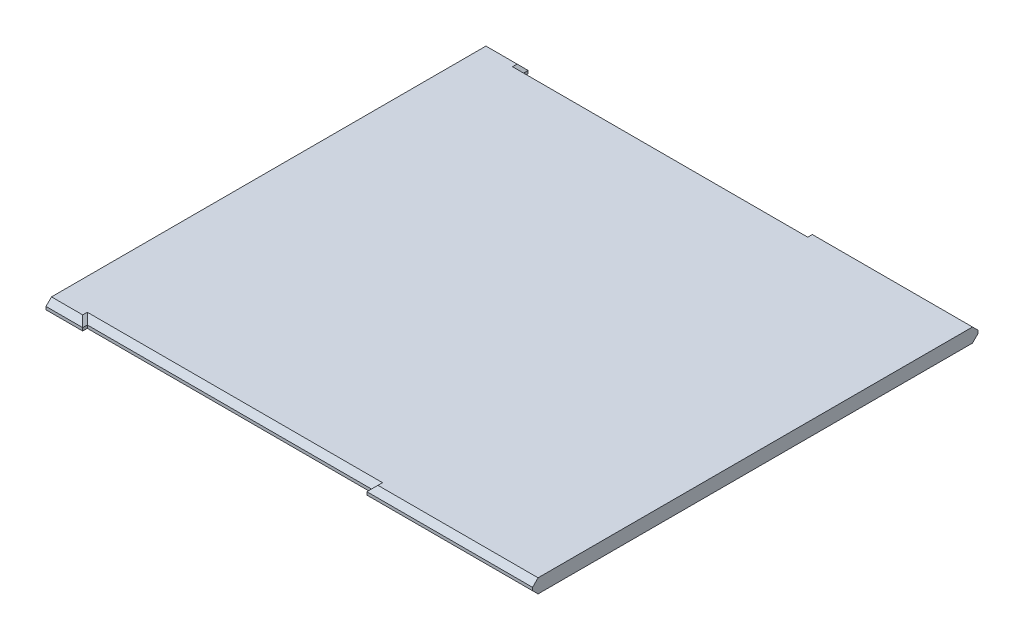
ISO-10303-21;
HEADER;
FILE_DESCRIPTION(('STEP AP214'),'2;1');
FILE_NAME('part.step','',(''),(''),'','','');
FILE_SCHEMA(('AUTOMOTIVE_DESIGN { 1 0 10303 214 1 1 1 1 }'));
ENDSEC;
DATA;
#1=APPLICATION_CONTEXT('core data for automotive mechanical design processes');
#2=APPLICATION_PROTOCOL_DEFINITION('international standard','automotive_design',2000,#1);
#3=PRODUCT_CONTEXT('',#1,'mechanical');
#4=PRODUCT('Part','Part','',(#3));
#5=PRODUCT_RELATED_PRODUCT_CATEGORY('part','',(#4));
#6=PRODUCT_DEFINITION_FORMATION('','',#4);
#7=PRODUCT_DEFINITION_CONTEXT('part definition',#1,'design');
#8=PRODUCT_DEFINITION('design','',#6,#7);
#9=PRODUCT_DEFINITION_SHAPE('','',#8);
#10=(LENGTH_UNIT() NAMED_UNIT(*) SI_UNIT(.MILLI.,.METRE.));
#11=(NAMED_UNIT(*) PLANE_ANGLE_UNIT() SI_UNIT($,.RADIAN.));
#12=(NAMED_UNIT(*) SI_UNIT($,.STERADIAN.) SOLID_ANGLE_UNIT());
#13=UNCERTAINTY_MEASURE_WITH_UNIT(LENGTH_MEASURE(1.E-05),#10,'distance_accuracy_value','');
#14=(GEOMETRIC_REPRESENTATION_CONTEXT(3) GLOBAL_UNCERTAINTY_ASSIGNED_CONTEXT((#13)) GLOBAL_UNIT_ASSIGNED_CONTEXT((#10,
#11,#12)) REPRESENTATION_CONTEXT('',''));
#15=CARTESIAN_POINT('',(0.,0.,0.));
#16=DIRECTION('',(0.,0.,1.));
#17=DIRECTION('',(1.,0.,0.));
#18=AXIS2_PLACEMENT_3D('',#15,#16,#17);
#19=CARTESIAN_POINT('',(-562.573544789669,19.05,-556.126720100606));
#20=DIRECTION('',(-1.,0.,0.));
#21=DIRECTION('',(0.,0.,1.));
#22=AXIS2_PLACEMENT_3D('',#19,#20,#21);
#23=PLANE('',#22);
#24=DIRECTION('',(0.,-1.,0.));
#25=VECTOR('',#24,1.);
#26=CARTESIAN_POINT('',(-562.573544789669,19.05,-556.126720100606));
#27=LINE('',#26,#25);
#28=CARTESIAN_POINT('',(-562.573544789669,4.0500000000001,-556.126720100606));
#29=VERTEX_POINT('',#28);
#30=CARTESIAN_POINT('',(-562.573544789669,-4.04999999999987,-556.126720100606));
#31=VERTEX_POINT('',#30);
#32=EDGE_CURVE('E395',#29,#31,#27,.T.);
#33=ORIENTED_EDGE('',*,*,#32,.T.);
#34=DIRECTION('',(0.,0.,-1.));
#35=VECTOR('',#34,1.);
#36=CARTESIAN_POINT('',(-562.573544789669,-4.04999999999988,-556.126720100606));
#37=LINE('',#36,#35);
#38=CARTESIAN_POINT('',(-562.573544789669,-4.04999999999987,-568.651720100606));
#39=VERTEX_POINT('',#38);
#40=EDGE_CURVE('E270',#31,#39,#37,.T.);
#41=ORIENTED_EDGE('',*,*,#40,.T.);
#42=DIRECTION('',(0.,-1.,0.));
#43=VECTOR('',#42,1.);
#44=CARTESIAN_POINT('',(-562.573544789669,19.05,-568.651720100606));
#45=LINE('',#44,#43);
#46=CARTESIAN_POINT('',(-562.573544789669,4.0500000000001,-568.651720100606));
#47=VERTEX_POINT('',#46);
#48=EDGE_CURVE('E229',#47,#39,#45,.T.);
#49=ORIENTED_EDGE('',*,*,#48,.F.);
#50=DIRECTION('',(0.,0.,1.));
#51=VECTOR('',#50,1.);
#52=CARTESIAN_POINT('',(-562.573544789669,4.0500000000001,-556.126720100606));
#53=LINE('',#52,#51);
#54=EDGE_CURVE('E264',#47,#29,#53,.T.);
#55=ORIENTED_EDGE('',*,*,#54,.T.);
#56=EDGE_LOOP('',(#33,#41,#49,#55));
#57=FACE_BOUND('',#56,.T.);
#58=ADVANCED_FACE('F44',(#57),#23,.F.);
#59=CARTESIAN_POINT('',(-562.573544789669,19.05,-568.651720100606));
#60=DIRECTION('',(0.,0.,1.));
#61=DIRECTION('',(1.,0.,0.));
#62=AXIS2_PLACEMENT_3D('',#59,#60,#61);
#63=PLANE('',#62);
#64=ORIENTED_EDGE('',*,*,#48,.T.);
#65=DIRECTION('',(-1.,0.,0.));
#66=VECTOR('',#65,1.);
#67=CARTESIAN_POINT('',(-562.573544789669,-4.04999999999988,-568.651720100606));
#68=LINE('',#67,#66);
#69=CARTESIAN_POINT('',(-662.573544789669,-4.04999999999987,-568.651720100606));
#70=VERTEX_POINT('',#69);
#71=EDGE_CURVE('E227',#39,#70,#68,.T.);
#72=ORIENTED_EDGE('',*,*,#71,.T.);
#73=DIRECTION('',(0.,-1.,0.));
#74=VECTOR('',#73,1.);
#75=CARTESIAN_POINT('',(-662.573544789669,19.05,-568.651720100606));
#76=LINE('',#75,#74);
#77=CARTESIAN_POINT('',(-662.573544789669,4.0500000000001,-568.651720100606));
#78=VERTEX_POINT('',#77);
#79=EDGE_CURVE('E215',#78,#70,#76,.T.);
#80=ORIENTED_EDGE('',*,*,#79,.F.);
#81=DIRECTION('',(1.,0.,0.));
#82=VECTOR('',#81,1.);
#83=CARTESIAN_POINT('',(-562.573544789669,4.0500000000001,-568.651720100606));
#84=LINE('',#83,#82);
#85=EDGE_CURVE('E228',#78,#47,#84,.T.);
#86=ORIENTED_EDGE('',*,*,#85,.T.);
#87=EDGE_LOOP('',(#64,#72,#80,#86));
#88=FACE_BOUND('',#87,.T.);
#89=ADVANCED_FACE('F223',(#88),#63,.F.);
#90=CARTESIAN_POINT('',(-662.573544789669,19.05,644.548279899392));
#91=DIRECTION('',(1.,0.,0.));
#92=DIRECTION('',(0.,0.,-1.));
#93=AXIS2_PLACEMENT_3D('',#90,#91,#92);
#94=PLANE('',#93);
#95=ORIENTED_EDGE('',*,*,#79,.T.);
#96=DIRECTION('',(0.,0.707106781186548,-0.707106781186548));
#97=VECTOR('',#96,1.);
#98=CARTESIAN_POINT('',(-662.573544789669,-4.04999999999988,-568.651720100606));
#99=LINE('',#98,#97);
#100=CARTESIAN_POINT('',(-662.573544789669,-19.05,-553.651720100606));
#101=VERTEX_POINT('',#100);
#102=EDGE_CURVE('E218',#70,#101,#99,.F.);
#103=ORIENTED_EDGE('',*,*,#102,.T.);
#104=DIRECTION('',(0.,0.,1.));
#105=VECTOR('',#104,1.);
#106=CARTESIAN_POINT('',(-662.573544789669,-19.05,644.548279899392));
#107=LINE('',#106,#105);
#108=CARTESIAN_POINT('',(-662.573544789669,-19.05,629.548279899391));
#109=VERTEX_POINT('',#108);
#110=EDGE_CURVE('E339',#101,#109,#107,.T.);
#111=ORIENTED_EDGE('',*,*,#110,.T.);
#112=DIRECTION('',(0.,-0.707106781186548,-0.707106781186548));
#113=VECTOR('',#112,1.);
#114=CARTESIAN_POINT('',(-662.573544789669,-4.04999999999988,644.548279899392));
#115=LINE('',#114,#113);
#116=CARTESIAN_POINT('',(-662.573544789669,-4.04999999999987,644.548279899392));
#117=VERTEX_POINT('',#116);
#118=EDGE_CURVE('E219',#109,#117,#115,.F.);
#119=ORIENTED_EDGE('',*,*,#118,.T.);
#120=DIRECTION('',(0.,-1.,0.));
#121=VECTOR('',#120,1.);
#122=CARTESIAN_POINT('',(-662.573544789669,19.05,644.548279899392));
#123=LINE('',#122,#121);
#124=CARTESIAN_POINT('',(-662.573544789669,4.0500000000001,644.548279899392));
#125=VERTEX_POINT('',#124);
#126=EDGE_CURVE('E231',#125,#117,#123,.T.);
#127=ORIENTED_EDGE('',*,*,#126,.F.);
#128=DIRECTION('',(0.,0.707106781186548,-0.707106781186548));
#129=VECTOR('',#128,1.);
#130=CARTESIAN_POINT('',(-662.573544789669,19.05,629.548279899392));
#131=LINE('',#130,#129);
#132=CARTESIAN_POINT('',(-662.573544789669,19.05,629.548279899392));
#133=VERTEX_POINT('',#132);
#134=EDGE_CURVE('E236',#125,#133,#131,.T.);
#135=ORIENTED_EDGE('',*,*,#134,.T.);
#136=DIRECTION('',(0.,0.,1.));
#137=VECTOR('',#136,1.);
#138=CARTESIAN_POINT('',(-662.573544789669,19.05,644.548279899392));
#139=LINE('',#138,#137);
#140=CARTESIAN_POINT('',(-662.573544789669,19.05,-553.651720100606));
#141=VERTEX_POINT('',#140);
#142=EDGE_CURVE('E212',#141,#133,#139,.T.);
#143=ORIENTED_EDGE('',*,*,#142,.F.);
#144=DIRECTION('',(0.,-0.707106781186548,-0.707106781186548));
#145=VECTOR('',#144,1.);
#146=CARTESIAN_POINT('',(-662.573544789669,19.05,-553.651720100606));
#147=LINE('',#146,#145);
#148=EDGE_CURVE('E207',#141,#78,#147,.T.);
#149=ORIENTED_EDGE('',*,*,#148,.T.);
#150=EDGE_LOOP('',(#95,#103,#111,#119,#127,#135,#143,#149));
#151=FACE_BOUND('',#150,.T.);
#152=ADVANCED_FACE('F211',(#151),#94,.F.);
#153=CARTESIAN_POINT('',(-562.573544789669,19.05,644.548279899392));
#154=DIRECTION('',(0.,0.,-1.));
#155=DIRECTION('',(-1.,0.,0.));
#156=AXIS2_PLACEMENT_3D('',#153,#154,#155);
#157=PLANE('',#156);
#158=ORIENTED_EDGE('',*,*,#126,.T.);
#159=DIRECTION('',(1.,0.,0.));
#160=VECTOR('',#159,1.);
#161=CARTESIAN_POINT('',(-562.573544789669,-4.04999999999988,644.548279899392));
#162=LINE('',#161,#160);
#163=CARTESIAN_POINT('',(-562.573544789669,-4.04999999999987,644.548279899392));
#164=VERTEX_POINT('',#163);
#165=EDGE_CURVE('E315',#117,#164,#162,.T.);
#166=ORIENTED_EDGE('',*,*,#165,.T.);
#167=DIRECTION('',(0.,-1.,0.));
#168=VECTOR('',#167,1.);
#169=CARTESIAN_POINT('',(-562.573544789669,19.05,644.548279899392));
#170=LINE('',#169,#168);
#171=CARTESIAN_POINT('',(-562.573544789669,4.0500000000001,644.548279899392));
#172=VERTEX_POINT('',#171);
#173=EDGE_CURVE('E419',#172,#164,#170,.T.);
#174=ORIENTED_EDGE('',*,*,#173,.F.);
#175=DIRECTION('',(-1.,0.,0.));
#176=VECTOR('',#175,1.);
#177=CARTESIAN_POINT('',(-662.573544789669,4.0500000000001,644.548279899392));
#178=LINE('',#177,#176);
#179=EDGE_CURVE('E309',#172,#125,#178,.T.);
#180=ORIENTED_EDGE('',*,*,#179,.T.);
#181=EDGE_LOOP('',(#158,#166,#174,#180));
#182=FACE_BOUND('',#181,.T.);
#183=ADVANCED_FACE('F430',(#182),#157,.F.);
#184=CARTESIAN_POINT('',(-562.573544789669,19.05,632.023279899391));
#185=DIRECTION('',(-1.,0.,0.));
#186=DIRECTION('',(0.,0.,1.));
#187=AXIS2_PLACEMENT_3D('',#184,#185,#186);
#188=PLANE('',#187);
#189=ORIENTED_EDGE('',*,*,#173,.T.);
#190=DIRECTION('',(0.,0.,-1.));
#191=VECTOR('',#190,1.);
#192=CARTESIAN_POINT('',(-562.573544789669,-4.04999999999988,632.023279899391));
#193=LINE('',#192,#191);
#194=CARTESIAN_POINT('',(-562.573544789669,-4.04999999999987,632.023279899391));
#195=VERTEX_POINT('',#194);
#196=EDGE_CURVE('E320',#164,#195,#193,.T.);
#197=ORIENTED_EDGE('',*,*,#196,.T.);
#198=DIRECTION('',(0.,-1.,0.));
#199=VECTOR('',#198,1.);
#200=CARTESIAN_POINT('',(-562.573544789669,19.05,632.023279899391));
#201=LINE('',#200,#199);
#202=CARTESIAN_POINT('',(-562.573544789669,4.0500000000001,632.023279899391));
#203=VERTEX_POINT('',#202);
#204=EDGE_CURVE('E417',#203,#195,#201,.T.);
#205=ORIENTED_EDGE('',*,*,#204,.F.);
#206=DIRECTION('',(0.,0.,1.));
#207=VECTOR('',#206,1.);
#208=CARTESIAN_POINT('',(-562.573544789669,4.0500000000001,644.548279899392));
#209=LINE('',#208,#207);
#210=EDGE_CURVE('E312',#203,#172,#209,.T.);
#211=ORIENTED_EDGE('',*,*,#210,.T.);
#212=EDGE_LOOP('',(#189,#197,#205,#211));
#213=FACE_BOUND('',#212,.T.);
#214=ADVANCED_FACE('F444',(#213),#188,.F.);
#215=CARTESIAN_POINT('',(211.426455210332,19.05,632.023279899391));
#216=DIRECTION('',(0.,0.,-1.));
#217=DIRECTION('',(-1.,0.,0.));
#218=AXIS2_PLACEMENT_3D('',#215,#216,#217);
#219=PLANE('',#218);
#220=ORIENTED_EDGE('',*,*,#204,.T.);
#221=DIRECTION('',(1.,0.,0.));
#222=VECTOR('',#221,1.);
#223=CARTESIAN_POINT('',(211.426455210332,-4.04999999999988,632.023279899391));
#224=LINE('',#223,#222);
#225=CARTESIAN_POINT('',(211.426455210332,-4.04999999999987,632.023279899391));
#226=VERTEX_POINT('',#225);
#227=EDGE_CURVE('E321',#195,#226,#224,.T.);
#228=ORIENTED_EDGE('',*,*,#227,.T.);
#229=DIRECTION('',(0.,-1.,0.));
#230=VECTOR('',#229,1.);
#231=CARTESIAN_POINT('',(211.426455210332,19.05,632.023279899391));
#232=LINE('',#231,#230);
#233=CARTESIAN_POINT('',(211.426455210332,4.0500000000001,632.023279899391));
#234=VERTEX_POINT('',#233);
#235=EDGE_CURVE('E414',#234,#226,#232,.T.);
#236=ORIENTED_EDGE('',*,*,#235,.F.);
#237=DIRECTION('',(-1.,0.,0.));
#238=VECTOR('',#237,1.);
#239=CARTESIAN_POINT('',(-562.573544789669,4.0500000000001,632.023279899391));
#240=LINE('',#239,#238);
#241=EDGE_CURVE('E317',#234,#203,#240,.T.);
#242=ORIENTED_EDGE('',*,*,#241,.T.);
#243=EDGE_LOOP('',(#220,#228,#236,#242));
#244=FACE_BOUND('',#243,.T.);
#245=ADVANCED_FACE('F450',(#244),#219,.F.);
#246=CARTESIAN_POINT('',(211.426455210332,19.05,632.023279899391));
#247=DIRECTION('',(1.,0.,0.));
#248=DIRECTION('',(0.,0.,-1.));
#249=AXIS2_PLACEMENT_3D('',#246,#247,#248);
#250=PLANE('',#249);
#251=ORIENTED_EDGE('',*,*,#235,.T.);
#252=DIRECTION('',(0.,0.,1.));
#253=VECTOR('',#252,1.);
#254=CARTESIAN_POINT('',(211.426455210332,-4.04999999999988,632.023279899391));
#255=LINE('',#254,#253);
#256=CARTESIAN_POINT('',(211.426455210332,-4.04999999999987,644.548279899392));
#257=VERTEX_POINT('',#256);
#258=EDGE_CURVE('E61',#226,#257,#255,.T.);
#259=ORIENTED_EDGE('',*,*,#258,.T.);
#260=DIRECTION('',(0.,-1.,0.));
#261=VECTOR('',#260,1.);
#262=CARTESIAN_POINT('',(211.426455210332,19.05,644.548279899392));
#263=LINE('',#262,#261);
#264=CARTESIAN_POINT('',(211.426455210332,4.0500000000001,644.548279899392));
#265=VERTEX_POINT('',#264);
#266=EDGE_CURVE('E412',#265,#257,#263,.T.);
#267=ORIENTED_EDGE('',*,*,#266,.F.);
#268=DIRECTION('',(0.,0.,-1.));
#269=VECTOR('',#268,1.);
#270=CARTESIAN_POINT('',(211.426455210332,4.0500000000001,632.023279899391));
#271=LINE('',#270,#269);
#272=EDGE_CURVE('E323',#265,#234,#271,.T.);
#273=ORIENTED_EDGE('',*,*,#272,.T.);
#274=EDGE_LOOP('',(#251,#259,#267,#273));
#275=FACE_BOUND('',#274,.T.);
#276=ADVANCED_FACE('F756',(#275),#250,.F.);
#277=CARTESIAN_POINT('',(211.426455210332,19.05,644.548279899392));
#278=DIRECTION('',(0.,0.,-1.));
#279=DIRECTION('',(-1.,0.,0.));
#280=AXIS2_PLACEMENT_3D('',#277,#278,#279);
#281=PLANE('',#280);
#282=ORIENTED_EDGE('',*,*,#266,.T.);
#283=DIRECTION('',(1.,0.,0.));
#284=VECTOR('',#283,1.);
#285=CARTESIAN_POINT('',(211.426455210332,-4.04999999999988,644.548279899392));
#286=LINE('',#285,#284);
#287=CARTESIAN_POINT('',(662.626455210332,-4.04999999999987,644.548279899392));
#288=VERTEX_POINT('',#287);
#289=EDGE_CURVE('E11',#257,#288,#286,.T.);
#290=ORIENTED_EDGE('',*,*,#289,.T.);
#291=DIRECTION('',(0.,-1.,0.));
#292=VECTOR('',#291,1.);
#293=CARTESIAN_POINT('',(662.626455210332,19.05,644.548279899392));
#294=LINE('',#293,#292);
#295=CARTESIAN_POINT('',(662.626455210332,4.0500000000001,644.548279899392));
#296=VERTEX_POINT('',#295);
#297=EDGE_CURVE('E411',#296,#288,#294,.T.);
#298=ORIENTED_EDGE('',*,*,#297,.F.);
#299=DIRECTION('',(-1.,0.,0.));
#300=VECTOR('',#299,1.);
#301=CARTESIAN_POINT('',(211.426455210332,4.0500000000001,644.548279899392));
#302=LINE('',#301,#300);
#303=EDGE_CURVE('E54',#296,#265,#302,.T.);
#304=ORIENTED_EDGE('',*,*,#303,.T.);
#305=EDGE_LOOP('',(#282,#290,#298,#304));
#306=FACE_BOUND('',#305,.T.);
#307=ADVANCED_FACE('F465',(#306),#281,.F.);
#308=CARTESIAN_POINT('',(662.626455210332,19.05,644.548279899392));
#309=DIRECTION('',(-1.,0.,0.));
#310=DIRECTION('',(0.,0.,1.));
#311=AXIS2_PLACEMENT_3D('',#308,#309,#310);
#312=PLANE('',#311);
#313=DIRECTION('',(0.,0.,-1.));
#314=VECTOR('',#313,1.);
#315=CARTESIAN_POINT('',(662.626455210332,-19.05,644.548279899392));
#316=LINE('',#315,#314);
#317=CARTESIAN_POINT('',(662.626455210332,-19.05,629.548279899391));
#318=VERTEX_POINT('',#317);
#319=CARTESIAN_POINT('',(662.626455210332,-19.05,-553.651720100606));
#320=VERTEX_POINT('',#319);
#321=EDGE_CURVE('E400',#318,#320,#316,.T.);
#322=ORIENTED_EDGE('',*,*,#321,.T.);
#323=DIRECTION('',(0.,-0.707106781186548,0.707106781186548));
#324=VECTOR('',#323,1.);
#325=CARTESIAN_POINT('',(662.626455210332,-4.04999999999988,-568.651720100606));
#326=LINE('',#325,#324);
#327=CARTESIAN_POINT('',(662.626455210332,-4.04999999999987,-568.651720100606));
#328=VERTEX_POINT('',#327);
#329=EDGE_CURVE('E290',#320,#328,#326,.F.);
#330=ORIENTED_EDGE('',*,*,#329,.T.);
#331=DIRECTION('',(0.,-1.,0.));
#332=VECTOR('',#331,1.);
#333=CARTESIAN_POINT('',(662.626455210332,19.05,-568.651720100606));
#334=LINE('',#333,#332);
#335=CARTESIAN_POINT('',(662.626455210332,4.0500000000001,-568.651720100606));
#336=VERTEX_POINT('',#335);
#337=EDGE_CURVE('E406',#336,#328,#334,.T.);
#338=ORIENTED_EDGE('',*,*,#337,.F.);
#339=DIRECTION('',(0.,0.707106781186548,0.707106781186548));
#340=VECTOR('',#339,1.);
#341=CARTESIAN_POINT('',(662.626455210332,19.05,-553.651720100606));
#342=LINE('',#341,#340);
#343=CARTESIAN_POINT('',(662.626455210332,19.05,-553.651720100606));
#344=VERTEX_POINT('',#343);
#345=EDGE_CURVE('E284',#336,#344,#342,.T.);
#346=ORIENTED_EDGE('',*,*,#345,.T.);
#347=DIRECTION('',(0.,0.,-1.));
#348=VECTOR('',#347,1.);
#349=CARTESIAN_POINT('',(662.626455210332,19.05,644.548279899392));
#350=LINE('',#349,#348);
#351=CARTESIAN_POINT('',(662.626455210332,19.05,629.548279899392));
#352=VERTEX_POINT('',#351);
#353=EDGE_CURVE('E383',#352,#344,#350,.T.);
#354=ORIENTED_EDGE('',*,*,#353,.F.);
#355=DIRECTION('',(0.,-0.707106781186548,0.707106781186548));
#356=VECTOR('',#355,1.);
#357=CARTESIAN_POINT('',(662.626455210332,19.05,629.548279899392));
#358=LINE('',#357,#356);
#359=EDGE_CURVE('E283',#352,#296,#358,.T.);
#360=ORIENTED_EDGE('',*,*,#359,.T.);
#361=ORIENTED_EDGE('',*,*,#297,.T.);
#362=DIRECTION('',(0.,0.707106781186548,0.707106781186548));
#363=VECTOR('',#362,1.);
#364=CARTESIAN_POINT('',(662.626455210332,-4.04999999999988,644.548279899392));
#365=LINE('',#364,#363);
#366=EDGE_CURVE('E281',#288,#318,#365,.F.);
#367=ORIENTED_EDGE('',*,*,#366,.T.);
#368=EDGE_LOOP('',(#322,#330,#338,#346,#354,#360,#361,#367));
#369=FACE_BOUND('',#368,.T.);
#370=ADVANCED_FACE('F389',(#369),#312,.F.);
#371=CARTESIAN_POINT('',(211.426455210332,19.05,-568.651720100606));
#372=DIRECTION('',(0.,0.,1.));
#373=DIRECTION('',(1.,0.,0.));
#374=AXIS2_PLACEMENT_3D('',#371,#372,#373);
#375=PLANE('',#374);
#376=ORIENTED_EDGE('',*,*,#337,.T.);
#377=DIRECTION('',(-1.,0.,0.));
#378=VECTOR('',#377,1.);
#379=CARTESIAN_POINT('',(211.426455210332,-4.04999999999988,-568.651720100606));
#380=LINE('',#379,#378);
#381=CARTESIAN_POINT('',(211.426455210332,-4.04999999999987,-568.651720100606));
#382=VERTEX_POINT('',#381);
#383=EDGE_CURVE('E276',#328,#382,#380,.T.);
#384=ORIENTED_EDGE('',*,*,#383,.T.);
#385=DIRECTION('',(0.,-1.,0.));
#386=VECTOR('',#385,1.);
#387=CARTESIAN_POINT('',(211.426455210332,19.05,-568.651720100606));
#388=LINE('',#387,#386);
#389=CARTESIAN_POINT('',(211.426455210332,4.0500000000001,-568.651720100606));
#390=VERTEX_POINT('',#389);
#391=EDGE_CURVE('E403',#390,#382,#388,.T.);
#392=ORIENTED_EDGE('',*,*,#391,.F.);
#393=DIRECTION('',(1.,0.,0.));
#394=VECTOR('',#393,1.);
#395=CARTESIAN_POINT('',(662.626455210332,4.0500000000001,-568.651720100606));
#396=LINE('',#395,#394);
#397=EDGE_CURVE('E280',#390,#336,#396,.T.);
#398=ORIENTED_EDGE('',*,*,#397,.T.);
#399=EDGE_LOOP('',(#376,#384,#392,#398));
#400=FACE_BOUND('',#399,.T.);
#401=ADVANCED_FACE('F501',(#400),#375,.F.);
#402=CARTESIAN_POINT('',(211.426455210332,19.05,-556.126720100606));
#403=DIRECTION('',(1.,0.,0.));
#404=DIRECTION('',(0.,0.,-1.));
#405=AXIS2_PLACEMENT_3D('',#402,#403,#404);
#406=PLANE('',#405);
#407=ORIENTED_EDGE('',*,*,#391,.T.);
#408=DIRECTION('',(0.,0.,1.));
#409=VECTOR('',#408,1.);
#410=CARTESIAN_POINT('',(211.426455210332,-4.04999999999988,-556.126720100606));
#411=LINE('',#410,#409);
#412=CARTESIAN_POINT('',(211.426455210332,-4.04999999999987,-556.126720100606));
#413=VERTEX_POINT('',#412);
#414=EDGE_CURVE('E274',#382,#413,#411,.T.);
#415=ORIENTED_EDGE('',*,*,#414,.T.);
#416=DIRECTION('',(0.,-1.,0.));
#417=VECTOR('',#416,1.);
#418=CARTESIAN_POINT('',(211.426455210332,19.05,-556.126720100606));
#419=LINE('',#418,#417);
#420=CARTESIAN_POINT('',(211.426455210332,4.0500000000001,-556.126720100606));
#421=VERTEX_POINT('',#420);
#422=EDGE_CURVE('E394',#421,#413,#419,.T.);
#423=ORIENTED_EDGE('',*,*,#422,.F.);
#424=DIRECTION('',(0.,0.,-1.));
#425=VECTOR('',#424,1.);
#426=CARTESIAN_POINT('',(211.426455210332,4.0500000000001,-568.651720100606));
#427=LINE('',#426,#425);
#428=EDGE_CURVE('E272',#421,#390,#427,.T.);
#429=ORIENTED_EDGE('',*,*,#428,.T.);
#430=EDGE_LOOP('',(#407,#415,#423,#429));
#431=FACE_BOUND('',#430,.T.);
#432=ADVANCED_FACE('F481',(#431),#406,.F.);
#433=CARTESIAN_POINT('',(211.426455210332,19.05,-556.126720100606));
#434=DIRECTION('',(0.,0.,1.));
#435=DIRECTION('',(1.,0.,0.));
#436=AXIS2_PLACEMENT_3D('',#433,#434,#435);
#437=PLANE('',#436);
#438=ORIENTED_EDGE('',*,*,#422,.T.);
#439=DIRECTION('',(-1.,0.,0.));
#440=VECTOR('',#439,1.);
#441=CARTESIAN_POINT('',(211.426455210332,-4.04999999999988,-556.126720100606));
#442=LINE('',#441,#440);
#443=EDGE_CURVE('E271',#413,#31,#442,.T.);
#444=ORIENTED_EDGE('',*,*,#443,.T.);
#445=ORIENTED_EDGE('',*,*,#32,.F.);
#446=DIRECTION('',(1.,0.,0.));
#447=VECTOR('',#446,1.);
#448=CARTESIAN_POINT('',(211.426455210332,4.0500000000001,-556.126720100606));
#449=LINE('',#448,#447);
#450=EDGE_CURVE('E267',#29,#421,#449,.T.);
#451=ORIENTED_EDGE('',*,*,#450,.T.);
#452=EDGE_LOOP('',(#438,#444,#445,#451));
#453=FACE_BOUND('',#452,.T.);
#454=ADVANCED_FACE('F484',(#453),#437,.F.);
#455=CARTESIAN_POINT('',(0.,19.05,0.));
#456=DIRECTION('',(0.,1.,0.));
#457=DIRECTION('',(0.,0.,1.));
#458=AXIS2_PLACEMENT_3D('',#455,#456,#457);
#459=PLANE('',#458);
#460=DIRECTION('',(0.,0.,-1.));
#461=VECTOR('',#460,1.);
#462=CARTESIAN_POINT('',(-577.573544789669,19.05,-568.651720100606));
#463=LINE('',#462,#461);
#464=CARTESIAN_POINT('',(-577.573544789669,19.05,-541.126720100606));
#465=VERTEX_POINT('',#464);
#466=CARTESIAN_POINT('',(-577.573544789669,19.05,-553.651720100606));
#467=VERTEX_POINT('',#466);
#468=EDGE_CURVE('E308',#465,#467,#463,.T.);
#469=ORIENTED_EDGE('',*,*,#468,.T.);
#470=DIRECTION('',(-1.,0.,0.));
#471=VECTOR('',#470,1.);
#472=CARTESIAN_POINT('',(-662.573544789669,19.05,-553.651720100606));
#473=LINE('',#472,#471);
#474=EDGE_CURVE('E306',#467,#141,#473,.T.);
#475=ORIENTED_EDGE('',*,*,#474,.T.);
#476=ORIENTED_EDGE('',*,*,#142,.T.);
#477=DIRECTION('',(1.,0.,0.));
#478=VECTOR('',#477,1.);
#479=CARTESIAN_POINT('',(-562.573544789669,19.05,629.548279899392));
#480=LINE('',#479,#478);
#481=CARTESIAN_POINT('',(-577.573544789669,19.05,629.548279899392));
#482=VERTEX_POINT('',#481);
#483=EDGE_CURVE('E300',#133,#482,#480,.T.);
#484=ORIENTED_EDGE('',*,*,#483,.T.);
#485=DIRECTION('',(0.,0.,-1.));
#486=VECTOR('',#485,1.);
#487=CARTESIAN_POINT('',(-577.573544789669,19.05,632.023279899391));
#488=LINE('',#487,#486);
#489=CARTESIAN_POINT('',(-577.573544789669,19.05,617.023279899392));
#490=VERTEX_POINT('',#489);
#491=EDGE_CURVE('E293',#482,#490,#488,.T.);
#492=ORIENTED_EDGE('',*,*,#491,.T.);
#493=DIRECTION('',(1.,0.,0.));
#494=VECTOR('',#493,1.);
#495=CARTESIAN_POINT('',(211.426455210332,19.05,617.023279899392));
#496=LINE('',#495,#494);
#497=CARTESIAN_POINT('',(226.426455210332,19.05,617.023279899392));
#498=VERTEX_POINT('',#497);
#499=EDGE_CURVE('E291',#490,#498,#496,.T.);
#500=ORIENTED_EDGE('',*,*,#499,.T.);
#501=DIRECTION('',(0.,0.,1.));
#502=VECTOR('',#501,1.);
#503=CARTESIAN_POINT('',(226.426455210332,19.05,644.548279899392));
#504=LINE('',#503,#502);
#505=CARTESIAN_POINT('',(226.426455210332,19.05,629.548279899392));
#506=VERTEX_POINT('',#505);
#507=EDGE_CURVE('E292',#498,#506,#504,.T.);
#508=ORIENTED_EDGE('',*,*,#507,.T.);
#509=DIRECTION('',(1.,0.,0.));
#510=VECTOR('',#509,1.);
#511=CARTESIAN_POINT('',(662.626455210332,19.05,629.548279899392));
#512=LINE('',#511,#510);
#513=EDGE_CURVE('E288',#506,#352,#512,.T.);
#514=ORIENTED_EDGE('',*,*,#513,.T.);
#515=ORIENTED_EDGE('',*,*,#353,.T.);
#516=DIRECTION('',(-1.,0.,0.));
#517=VECTOR('',#516,1.);
#518=CARTESIAN_POINT('',(211.426455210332,19.05,-553.651720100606));
#519=LINE('',#518,#517);
#520=CARTESIAN_POINT('',(226.426455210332,19.05,-553.651720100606));
#521=VERTEX_POINT('',#520);
#522=EDGE_CURVE('E305',#344,#521,#519,.T.);
#523=ORIENTED_EDGE('',*,*,#522,.T.);
#524=DIRECTION('',(0.,0.,1.));
#525=VECTOR('',#524,1.);
#526=CARTESIAN_POINT('',(226.426455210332,19.05,-556.126720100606));
#527=LINE('',#526,#525);
#528=CARTESIAN_POINT('',(226.426455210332,19.05,-541.126720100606));
#529=VERTEX_POINT('',#528);
#530=EDGE_CURVE('E299',#521,#529,#527,.T.);
#531=ORIENTED_EDGE('',*,*,#530,.T.);
#532=DIRECTION('',(-1.,0.,0.));
#533=VECTOR('',#532,1.);
#534=CARTESIAN_POINT('',(-562.573544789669,19.05,-541.126720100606));
#535=LINE('',#534,#533);
#536=EDGE_CURVE('E303',#529,#465,#535,.T.);
#537=ORIENTED_EDGE('',*,*,#536,.T.);
#538=EDGE_LOOP('',(#469,#475,#476,#484,#492,#500,#508,#514,#515,#523,#531,#537));
#539=FACE_BOUND('',#538,.T.);
#540=ADVANCED_FACE('F382',(#539),#459,.T.);
#541=CARTESIAN_POINT('',(0.,-19.05,0.));
#542=DIRECTION('',(0.,1.,0.));
#543=DIRECTION('',(0.,0.,1.));
#544=AXIS2_PLACEMENT_3D('',#541,#542,#543);
#545=PLANE('',#544);
#546=ORIENTED_EDGE('',*,*,#110,.F.);
#547=DIRECTION('',(1.,0.,0.));
#548=VECTOR('',#547,1.);
#549=CARTESIAN_POINT('',(0.,-19.05,-553.651720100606));
#550=LINE('',#549,#548);
#551=CARTESIAN_POINT('',(-577.573544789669,-19.05,-553.651720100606));
#552=VERTEX_POINT('',#551);
#553=EDGE_CURVE('E263',#101,#552,#550,.T.);
#554=ORIENTED_EDGE('',*,*,#553,.T.);
#555=DIRECTION('',(0.,0.,1.));
#556=VECTOR('',#555,1.);
#557=CARTESIAN_POINT('',(-577.573544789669,-19.05,0.));
#558=LINE('',#557,#556);
#559=CARTESIAN_POINT('',(-577.573544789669,-19.05,-541.126720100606));
#560=VERTEX_POINT('',#559);
#561=EDGE_CURVE('E261',#552,#560,#558,.T.);
#562=ORIENTED_EDGE('',*,*,#561,.T.);
#563=DIRECTION('',(1.,0.,0.));
#564=VECTOR('',#563,1.);
#565=CARTESIAN_POINT('',(0.,-19.05,-541.126720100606));
#566=LINE('',#565,#564);
#567=CARTESIAN_POINT('',(226.426455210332,-19.05,-541.126720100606));
#568=VERTEX_POINT('',#567);
#569=EDGE_CURVE('E259',#560,#568,#566,.T.);
#570=ORIENTED_EDGE('',*,*,#569,.T.);
#571=DIRECTION('',(0.,0.,-1.));
#572=VECTOR('',#571,1.);
#573=CARTESIAN_POINT('',(226.426455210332,-19.05,0.));
#574=LINE('',#573,#572);
#575=CARTESIAN_POINT('',(226.426455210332,-19.05,-553.651720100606));
#576=VERTEX_POINT('',#575);
#577=EDGE_CURVE('E260',#568,#576,#574,.T.);
#578=ORIENTED_EDGE('',*,*,#577,.T.);
#579=DIRECTION('',(1.,0.,0.));
#580=VECTOR('',#579,1.);
#581=CARTESIAN_POINT('',(0.,-19.05,-553.651720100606));
#582=LINE('',#581,#580);
#583=EDGE_CURVE('E254',#576,#320,#582,.T.);
#584=ORIENTED_EDGE('',*,*,#583,.T.);
#585=ORIENTED_EDGE('',*,*,#321,.F.);
#586=DIRECTION('',(-1.,0.,0.));
#587=VECTOR('',#586,1.);
#588=CARTESIAN_POINT('',(0.,-19.05,629.548279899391));
#589=LINE('',#588,#587);
#590=CARTESIAN_POINT('',(226.426455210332,-19.05,629.548279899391));
#591=VERTEX_POINT('',#590);
#592=EDGE_CURVE('E244',#318,#591,#589,.T.);
#593=ORIENTED_EDGE('',*,*,#592,.T.);
#594=DIRECTION('',(0.,0.,-1.));
#595=VECTOR('',#594,1.);
#596=CARTESIAN_POINT('',(226.426455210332,-19.05,0.));
#597=LINE('',#596,#595);
#598=CARTESIAN_POINT('',(226.426455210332,-19.05,617.023279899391));
#599=VERTEX_POINT('',#598);
#600=EDGE_CURVE('E250',#591,#599,#597,.T.);
#601=ORIENTED_EDGE('',*,*,#600,.T.);
#602=DIRECTION('',(-1.,0.,0.));
#603=VECTOR('',#602,1.);
#604=CARTESIAN_POINT('',(0.,-19.05,617.023279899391));
#605=LINE('',#604,#603);
#606=CARTESIAN_POINT('',(-577.573544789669,-19.05,617.023279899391));
#607=VERTEX_POINT('',#606);
#608=EDGE_CURVE('E248',#599,#607,#605,.T.);
#609=ORIENTED_EDGE('',*,*,#608,.T.);
#610=DIRECTION('',(0.,0.,1.));
#611=VECTOR('',#610,1.);
#612=CARTESIAN_POINT('',(-577.573544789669,-19.05,0.));
#613=LINE('',#612,#611);
#614=CARTESIAN_POINT('',(-577.573544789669,-19.05,629.548279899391));
#615=VERTEX_POINT('',#614);
#616=EDGE_CURVE('E253',#607,#615,#613,.T.);
#617=ORIENTED_EDGE('',*,*,#616,.T.);
#618=DIRECTION('',(-1.,0.,0.));
#619=VECTOR('',#618,1.);
#620=CARTESIAN_POINT('',(0.,-19.05,629.548279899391));
#621=LINE('',#620,#619);
#622=EDGE_CURVE('E251',#615,#109,#621,.T.);
#623=ORIENTED_EDGE('',*,*,#622,.T.);
#624=EDGE_LOOP('',(#546,#554,#562,#570,#578,#584,#585,#593,#601,#609,#617,#623));
#625=FACE_BOUND('',#624,.T.);
#626=ADVANCED_FACE('F470',(#625),#545,.F.);
#627=CARTESIAN_POINT('',(211.426455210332,-4.04999999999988,-568.651720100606));
#628=DIRECTION('',(0.,0.707106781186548,0.707106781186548));
#629=DIRECTION('',(-1.,0.,0.));
#630=AXIS2_PLACEMENT_3D('',#627,#628,#629);
#631=PLANE('',#630);
#632=ORIENTED_EDGE('',*,*,#329,.F.);
#633=ORIENTED_EDGE('',*,*,#583,.F.);
#634=DIRECTION('',(-0.577350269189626,0.577350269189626,-0.577350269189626));
#635=VECTOR('',#634,1.);
#636=CARTESIAN_POINT('',(211.426455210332,-4.04999999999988,-568.651720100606));
#637=LINE('',#636,#635);
#638=EDGE_CURVE('E340',#382,#576,#637,.F.);
#639=ORIENTED_EDGE('',*,*,#638,.F.);
#640=ORIENTED_EDGE('',*,*,#383,.F.);
#641=EDGE_LOOP('',(#632,#633,#639,#640));
#642=FACE_BOUND('',#641,.T.);
#643=ADVANCED_FACE('F472',(#642),#631,.F.);
#644=CARTESIAN_POINT('',(211.426455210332,-4.04999999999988,-556.126720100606));
#645=DIRECTION('',(0.707106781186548,0.707106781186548,0.));
#646=DIRECTION('',(0.,0.,1.));
#647=AXIS2_PLACEMENT_3D('',#644,#645,#646);
#648=PLANE('',#647);
#649=ORIENTED_EDGE('',*,*,#638,.T.);
#650=ORIENTED_EDGE('',*,*,#577,.F.);
#651=DIRECTION('',(-0.577350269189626,0.577350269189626,-0.577350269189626));
#652=VECTOR('',#651,1.);
#653=CARTESIAN_POINT('',(211.426455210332,-4.04999999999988,-556.126720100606));
#654=LINE('',#653,#652);
#655=EDGE_CURVE('E331',#413,#568,#654,.F.);
#656=ORIENTED_EDGE('',*,*,#655,.F.);
#657=ORIENTED_EDGE('',*,*,#414,.F.);
#658=EDGE_LOOP('',(#649,#650,#656,#657));
#659=FACE_BOUND('',#658,.T.);
#660=ADVANCED_FACE('F478',(#659),#648,.F.);
#661=CARTESIAN_POINT('',(211.426455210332,-4.04999999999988,-556.126720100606));
#662=DIRECTION('',(0.,0.707106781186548,0.707106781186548));
#663=DIRECTION('',(-1.,0.,0.));
#664=AXIS2_PLACEMENT_3D('',#661,#662,#663);
#665=PLANE('',#664);
#666=ORIENTED_EDGE('',*,*,#655,.T.);
#667=ORIENTED_EDGE('',*,*,#569,.F.);
#668=DIRECTION('',(0.577350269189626,0.577350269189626,-0.577350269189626));
#669=VECTOR('',#668,1.);
#670=CARTESIAN_POINT('',(-562.573544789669,-4.04999999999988,-556.126720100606));
#671=LINE('',#670,#669);
#672=EDGE_CURVE('E329',#31,#560,#671,.F.);
#673=ORIENTED_EDGE('',*,*,#672,.F.);
#674=ORIENTED_EDGE('',*,*,#443,.F.);
#675=EDGE_LOOP('',(#666,#667,#673,#674));
#676=FACE_BOUND('',#675,.T.);
#677=ADVANCED_FACE('F540',(#676),#665,.F.);
#678=CARTESIAN_POINT('',(-562.573544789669,-4.04999999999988,-556.126720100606));
#679=DIRECTION('',(-0.707106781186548,0.707106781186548,0.));
#680=DIRECTION('',(0.,0.,-1.));
#681=AXIS2_PLACEMENT_3D('',#678,#679,#680);
#682=PLANE('',#681);
#683=ORIENTED_EDGE('',*,*,#672,.T.);
#684=ORIENTED_EDGE('',*,*,#561,.F.);
#685=DIRECTION('',(0.577350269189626,0.577350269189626,-0.577350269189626));
#686=VECTOR('',#685,1.);
#687=CARTESIAN_POINT('',(-566.748544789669,-8.22499999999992,-564.476720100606));
#688=LINE('',#687,#686);
#689=EDGE_CURVE('E330',#39,#552,#688,.F.);
#690=ORIENTED_EDGE('',*,*,#689,.F.);
#691=ORIENTED_EDGE('',*,*,#40,.F.);
#692=EDGE_LOOP('',(#683,#684,#690,#691));
#693=FACE_BOUND('',#692,.T.);
#694=ADVANCED_FACE('F514',(#693),#682,.F.);
#695=CARTESIAN_POINT('',(-562.573544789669,-4.04999999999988,-568.651720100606));
#696=DIRECTION('',(0.,0.707106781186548,0.707106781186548));
#697=DIRECTION('',(-1.,0.,0.));
#698=AXIS2_PLACEMENT_3D('',#695,#696,#697);
#699=PLANE('',#698);
#700=ORIENTED_EDGE('',*,*,#689,.T.);
#701=ORIENTED_EDGE('',*,*,#553,.F.);
#702=ORIENTED_EDGE('',*,*,#102,.F.);
#703=ORIENTED_EDGE('',*,*,#71,.F.);
#704=EDGE_LOOP('',(#700,#701,#702,#703));
#705=FACE_BOUND('',#704,.T.);
#706=ADVANCED_FACE('F510',(#705),#699,.F.);
#707=CARTESIAN_POINT('',(0.,19.05,-553.651720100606));
#708=DIRECTION('',(0.,0.707106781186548,-0.707106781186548));
#709=DIRECTION('',(1.,0.,0.));
#710=AXIS2_PLACEMENT_3D('',#707,#708,#709);
#711=PLANE('',#710);
#712=ORIENTED_EDGE('',*,*,#345,.F.);
#713=ORIENTED_EDGE('',*,*,#397,.F.);
#714=DIRECTION('',(-0.577350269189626,-0.577350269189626,-0.577350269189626));
#715=VECTOR('',#714,1.);
#716=CARTESIAN_POINT('',(410.977028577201,203.600573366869,-369.101146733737));
#717=LINE('',#716,#715);
#718=EDGE_CURVE('E332',#521,#390,#717,.T.);
#719=ORIENTED_EDGE('',*,*,#718,.F.);
#720=ORIENTED_EDGE('',*,*,#522,.F.);
#721=EDGE_LOOP('',(#712,#713,#719,#720));
#722=FACE_BOUND('',#721,.T.);
#723=ADVANCED_FACE('F504',(#722),#711,.T.);
#724=CARTESIAN_POINT('',(226.426455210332,19.05,0.));
#725=DIRECTION('',(-0.707106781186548,0.707106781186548,0.));
#726=DIRECTION('',(0.,0.,-1.));
#727=AXIS2_PLACEMENT_3D('',#724,#725,#726);
#728=PLANE('',#727);
#729=ORIENTED_EDGE('',*,*,#718,.T.);
#730=ORIENTED_EDGE('',*,*,#428,.F.);
#731=DIRECTION('',(0.577350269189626,0.577350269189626,0.577350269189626));
#732=VECTOR('',#731,1.);
#733=CARTESIAN_POINT('',(150.950970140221,-56.4254850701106,-616.602205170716));
#734=LINE('',#733,#732);
#735=EDGE_CURVE('E347',#529,#421,#734,.F.);
#736=ORIENTED_EDGE('',*,*,#735,.F.);
#737=ORIENTED_EDGE('',*,*,#530,.F.);
#738=EDGE_LOOP('',(#729,#730,#736,#737));
#739=FACE_BOUND('',#738,.T.);
#740=ADVANCED_FACE('F498',(#739),#728,.T.);
#741=CARTESIAN_POINT('',(0.,19.05,-541.126720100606));
#742=DIRECTION('',(0.,0.707106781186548,-0.707106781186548));
#743=DIRECTION('',(1.,0.,0.));
#744=AXIS2_PLACEMENT_3D('',#741,#742,#743);
#745=PLANE('',#744);
#746=ORIENTED_EDGE('',*,*,#735,.T.);
#747=ORIENTED_EDGE('',*,*,#450,.F.);
#748=DIRECTION('',(-0.577350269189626,0.577350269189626,0.577350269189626));
#749=VECTOR('',#748,1.);
#750=CARTESIAN_POINT('',(-757.949118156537,199.425573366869,-360.751146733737));
#751=LINE('',#750,#749);
#752=EDGE_CURVE('E345',#465,#29,#751,.F.);
#753=ORIENTED_EDGE('',*,*,#752,.F.);
#754=ORIENTED_EDGE('',*,*,#536,.F.);
#755=EDGE_LOOP('',(#746,#747,#753,#754));
#756=FACE_BOUND('',#755,.T.);
#757=ADVANCED_FACE('F489',(#756),#745,.T.);
#758=CARTESIAN_POINT('',(-577.573544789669,19.05,0.));
#759=DIRECTION('',(0.707106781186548,0.707106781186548,0.));
#760=DIRECTION('',(0.,0.,1.));
#761=AXIS2_PLACEMENT_3D('',#758,#759,#760);
#762=PLANE('',#761);
#763=ORIENTED_EDGE('',*,*,#752,.T.);
#764=ORIENTED_EDGE('',*,*,#54,.F.);
#765=DIRECTION('',(-0.577350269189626,0.577350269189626,0.577350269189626));
#766=VECTOR('',#765,1.);
#767=CARTESIAN_POINT('',(-762.124118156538,203.600573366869,-369.101146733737));
#768=LINE('',#767,#766);
#769=EDGE_CURVE('E237',#467,#47,#768,.F.);
#770=ORIENTED_EDGE('',*,*,#769,.F.);
#771=ORIENTED_EDGE('',*,*,#468,.F.);
#772=EDGE_LOOP('',(#763,#764,#770,#771));
#773=FACE_BOUND('',#772,.T.);
#774=ADVANCED_FACE('F497',(#773),#762,.T.);
#775=CARTESIAN_POINT('',(0.,19.05,-553.651720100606));
#776=DIRECTION('',(0.,0.707106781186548,-0.707106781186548));
#777=DIRECTION('',(1.,0.,0.));
#778=AXIS2_PLACEMENT_3D('',#775,#776,#777);
#779=PLANE('',#778);
#780=ORIENTED_EDGE('',*,*,#769,.T.);
#781=ORIENTED_EDGE('',*,*,#85,.F.);
#782=ORIENTED_EDGE('',*,*,#148,.F.);
#783=ORIENTED_EDGE('',*,*,#474,.F.);
#784=EDGE_LOOP('',(#780,#781,#782,#783));
#785=FACE_BOUND('',#784,.T.);
#786=ADVANCED_FACE('F233',(#785),#779,.T.);
#787=CARTESIAN_POINT('',(211.426455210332,-4.04999999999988,644.548279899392));
#788=DIRECTION('',(0.,0.707106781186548,-0.707106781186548));
#789=DIRECTION('',(1.,0.,0.));
#790=AXIS2_PLACEMENT_3D('',#787,#788,#789);
#791=PLANE('',#790);
#792=ORIENTED_EDGE('',*,*,#366,.F.);
#793=ORIENTED_EDGE('',*,*,#289,.F.);
#794=DIRECTION('',(0.577350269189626,-0.577350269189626,-0.577350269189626));
#795=VECTOR('',#794,1.);
#796=CARTESIAN_POINT('',(211.426455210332,-4.04999999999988,644.548279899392));
#797=LINE('',#796,#795);
#798=EDGE_CURVE('E342',#591,#257,#797,.F.);
#799=ORIENTED_EDGE('',*,*,#798,.F.);
#800=ORIENTED_EDGE('',*,*,#592,.F.);
#801=EDGE_LOOP('',(#792,#793,#799,#800));
#802=FACE_BOUND('',#801,.T.);
#803=ADVANCED_FACE('F463',(#802),#791,.F.);
#804=CARTESIAN_POINT('',(211.426455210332,-4.04999999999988,632.023279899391));
#805=DIRECTION('',(0.707106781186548,0.707106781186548,0.));
#806=DIRECTION('',(0.,0.,1.));
#807=AXIS2_PLACEMENT_3D('',#804,#805,#806);
#808=PLANE('',#807);
#809=ORIENTED_EDGE('',*,*,#798,.T.);
#810=ORIENTED_EDGE('',*,*,#258,.F.);
#811=DIRECTION('',(0.577350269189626,-0.577350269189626,-0.577350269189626));
#812=VECTOR('',#811,1.);
#813=CARTESIAN_POINT('',(211.426455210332,-4.04999999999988,632.023279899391));
#814=LINE('',#813,#812);
#815=EDGE_CURVE('E356',#599,#226,#814,.F.);
#816=ORIENTED_EDGE('',*,*,#815,.F.);
#817=ORIENTED_EDGE('',*,*,#600,.F.);
#818=EDGE_LOOP('',(#809,#810,#816,#817));
#819=FACE_BOUND('',#818,.T.);
#820=ADVANCED_FACE('F454',(#819),#808,.F.);
#821=CARTESIAN_POINT('',(211.426455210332,-4.04999999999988,632.023279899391));
#822=DIRECTION('',(0.,0.707106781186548,-0.707106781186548));
#823=DIRECTION('',(1.,0.,0.));
#824=AXIS2_PLACEMENT_3D('',#821,#822,#823);
#825=PLANE('',#824);
#826=ORIENTED_EDGE('',*,*,#815,.T.);
#827=ORIENTED_EDGE('',*,*,#227,.F.);
#828=DIRECTION('',(-0.577350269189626,-0.577350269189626,-0.577350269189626));
#829=VECTOR('',#828,1.);
#830=CARTESIAN_POINT('',(-562.573544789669,-4.04999999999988,632.023279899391));
#831=LINE('',#830,#829);
#832=EDGE_CURVE('E351',#607,#195,#831,.F.);
#833=ORIENTED_EDGE('',*,*,#832,.F.);
#834=ORIENTED_EDGE('',*,*,#608,.F.);
#835=EDGE_LOOP('',(#826,#827,#833,#834));
#836=FACE_BOUND('',#835,.T.);
#837=ADVANCED_FACE('F449',(#836),#825,.F.);
#838=CARTESIAN_POINT('',(-562.573544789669,-4.04999999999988,632.023279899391));
#839=DIRECTION('',(-0.707106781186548,0.707106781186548,0.));
#840=DIRECTION('',(0.,0.,-1.));
#841=AXIS2_PLACEMENT_3D('',#838,#839,#840);
#842=PLANE('',#841);
#843=ORIENTED_EDGE('',*,*,#832,.T.);
#844=ORIENTED_EDGE('',*,*,#196,.F.);
#845=DIRECTION('',(-0.577350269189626,-0.577350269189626,-0.577350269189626));
#846=VECTOR('',#845,1.);
#847=CARTESIAN_POINT('',(-566.748544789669,-8.22499999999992,640.373279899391));
#848=LINE('',#847,#846);
#849=EDGE_CURVE('E353',#615,#164,#848,.F.);
#850=ORIENTED_EDGE('',*,*,#849,.F.);
#851=ORIENTED_EDGE('',*,*,#616,.F.);
#852=EDGE_LOOP('',(#843,#844,#850,#851));
#853=FACE_BOUND('',#852,.T.);
#854=ADVANCED_FACE('F438',(#853),#842,.F.);
#855=CARTESIAN_POINT('',(-562.573544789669,-4.04999999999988,644.548279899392));
#856=DIRECTION('',(0.,0.707106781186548,-0.707106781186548));
#857=DIRECTION('',(1.,0.,0.));
#858=AXIS2_PLACEMENT_3D('',#855,#856,#857);
#859=PLANE('',#858);
#860=ORIENTED_EDGE('',*,*,#118,.F.);
#861=ORIENTED_EDGE('',*,*,#622,.F.);
#862=ORIENTED_EDGE('',*,*,#849,.T.);
#863=ORIENTED_EDGE('',*,*,#165,.F.);
#864=EDGE_LOOP('',(#860,#861,#862,#863));
#865=FACE_BOUND('',#864,.T.);
#866=ADVANCED_FACE('F433',(#865),#859,.F.);
#867=CARTESIAN_POINT('',(0.,19.05,629.548279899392));
#868=DIRECTION('',(0.,0.707106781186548,0.707106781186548));
#869=DIRECTION('',(-1.,0.,0.));
#870=AXIS2_PLACEMENT_3D('',#867,#868,#869);
#871=PLANE('',#870);
#872=ORIENTED_EDGE('',*,*,#359,.F.);
#873=ORIENTED_EDGE('',*,*,#513,.F.);
#874=DIRECTION('',(-0.577350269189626,-0.577350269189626,0.577350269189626));
#875=VECTOR('',#874,1.);
#876=CARTESIAN_POINT('',(150.950970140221,-56.4254850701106,705.023764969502));
#877=LINE('',#876,#875);
#878=EDGE_CURVE('E49',#265,#506,#877,.F.);
#879=ORIENTED_EDGE('',*,*,#878,.F.);
#880=ORIENTED_EDGE('',*,*,#303,.F.);
#881=EDGE_LOOP('',(#872,#873,#879,#880));
#882=FACE_BOUND('',#881,.T.);
#883=ADVANCED_FACE('F48',(#882),#871,.T.);
#884=CARTESIAN_POINT('',(226.426455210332,19.05,0.));
#885=DIRECTION('',(-0.707106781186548,0.707106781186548,0.));
#886=DIRECTION('',(0.,0.,-1.));
#887=AXIS2_PLACEMENT_3D('',#884,#885,#886);
#888=PLANE('',#887);
#889=ORIENTED_EDGE('',*,*,#878,.T.);
#890=ORIENTED_EDGE('',*,*,#507,.F.);
#891=DIRECTION('',(-0.577350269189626,-0.577350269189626,0.577350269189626));
#892=VECTOR('',#891,1.);
#893=CARTESIAN_POINT('',(150.950970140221,-56.4254850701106,692.498764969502));
#894=LINE('',#893,#892);
#895=EDGE_CURVE('E364',#234,#498,#894,.F.);
#896=ORIENTED_EDGE('',*,*,#895,.F.);
#897=ORIENTED_EDGE('',*,*,#272,.F.);
#898=EDGE_LOOP('',(#889,#890,#896,#897));
#899=FACE_BOUND('',#898,.T.);
#900=ADVANCED_FACE('F376',(#899),#888,.T.);
#901=CARTESIAN_POINT('',(0.,19.05,617.023279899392));
#902=DIRECTION('',(0.,0.707106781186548,0.707106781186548));
#903=DIRECTION('',(-1.,0.,0.));
#904=AXIS2_PLACEMENT_3D('',#901,#902,#903);
#905=PLANE('',#904);
#906=ORIENTED_EDGE('',*,*,#895,.T.);
#907=ORIENTED_EDGE('',*,*,#499,.F.);
#908=DIRECTION('',(0.577350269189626,-0.577350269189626,0.577350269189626));
#909=VECTOR('',#908,1.);
#910=CARTESIAN_POINT('',(-783.247971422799,224.72442663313,411.348853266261));
#911=LINE('',#910,#909);
#912=EDGE_CURVE('E361',#203,#490,#911,.F.);
#913=ORIENTED_EDGE('',*,*,#912,.F.);
#914=ORIENTED_EDGE('',*,*,#241,.F.);
#915=EDGE_LOOP('',(#906,#907,#913,#914));
#916=FACE_BOUND('',#915,.T.);
#917=ADVANCED_FACE('F634',(#916),#905,.T.);
#918=CARTESIAN_POINT('',(-577.573544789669,19.05,0.));
#919=DIRECTION('',(0.707106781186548,0.707106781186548,0.));
#920=DIRECTION('',(0.,0.,1.));
#921=AXIS2_PLACEMENT_3D('',#918,#919,#920);
#922=PLANE('',#921);
#923=ORIENTED_EDGE('',*,*,#912,.T.);
#924=ORIENTED_EDGE('',*,*,#491,.F.);
#925=DIRECTION('',(0.577350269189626,-0.577350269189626,0.577350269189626));
#926=VECTOR('',#925,1.);
#927=CARTESIAN_POINT('',(-787.422971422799,228.899426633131,419.698853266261));
#928=LINE('',#927,#926);
#929=EDGE_CURVE('E363',#172,#482,#928,.F.);
#930=ORIENTED_EDGE('',*,*,#929,.F.);
#931=ORIENTED_EDGE('',*,*,#210,.F.);
#932=EDGE_LOOP('',(#923,#924,#930,#931));
#933=FACE_BOUND('',#932,.T.);
#934=ADVANCED_FACE('F645',(#933),#922,.T.);
#935=CARTESIAN_POINT('',(0.,19.05,629.548279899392));
#936=DIRECTION('',(0.,0.707106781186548,0.707106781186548));
#937=DIRECTION('',(-1.,0.,0.));
#938=AXIS2_PLACEMENT_3D('',#935,#936,#937);
#939=PLANE('',#938);
#940=ORIENTED_EDGE('',*,*,#134,.F.);
#941=ORIENTED_EDGE('',*,*,#179,.F.);
#942=ORIENTED_EDGE('',*,*,#929,.T.);
#943=ORIENTED_EDGE('',*,*,#483,.F.);
#944=EDGE_LOOP('',(#940,#941,#942,#943));
#945=FACE_BOUND('',#944,.T.);
#946=ADVANCED_FACE('F649',(#945),#939,.T.);
#947=CLOSED_SHELL('',(#58,#89,#152,#183,#214,#245,#276,#307,#370,#401,#432,#454,#540,#626,#643,
#660,#677,#694,#706,#723,#740,#757,#774,#786,#803,#820,#837,#854,#866,#883,#900,#917,#934,#946));
#948=MANIFOLD_SOLID_BREP('B2',#947);
#949=ADVANCED_BREP_SHAPE_REPRESENTATION('',(#18,#948),#14);
#950=SHAPE_DEFINITION_REPRESENTATION(#9,#949);
ENDSEC;
END-ISO-10303-21;
